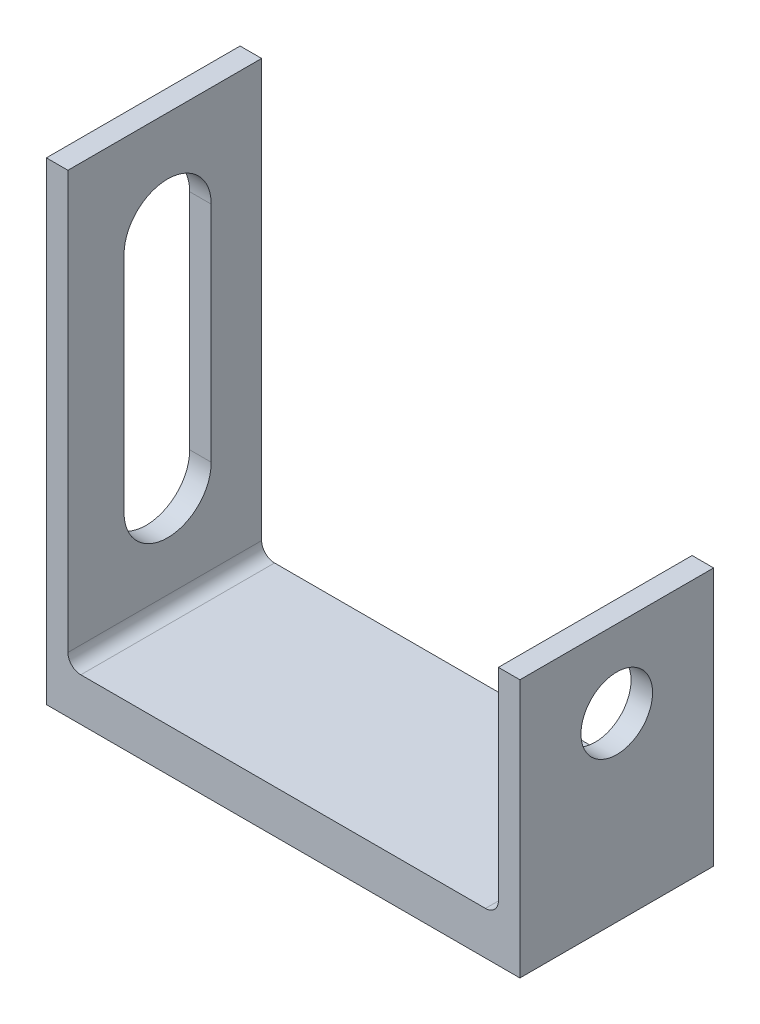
from build123d import *

# Parameters (mm, degrees)
SKETCH1_W           = 100
SKETCH1_H           = 45
SKETCH1_W_2         = 5
BOSS_EXTRUDE1_DEPTH = 10
SKETCH1_4_W         = 5
SKETCH1_4_H         = 45
BOSS_EXTRUDE2_DEPTH = 100
SKETCH1_5_W         = 5
SKETCH1_5_H         = 45
BOSS_EXTRUDE3_DEPTH = 50
FILLET1_R           = 3
FILLET2_R           = 3
CUT_EXTRUDE1_DEPTH  = 40
SKETCH4_R           = 8.315
CUT_EXTRUDE3_DEPTH  = 40


with BuildPart() as part:
    # Sketch1 → Boss-Extrude1 (new body)
    with BuildSketch(Plane(origin=(0, 0, 0), x_dir=(1, 0, 0), z_dir=(0, 1, 0))):
        with Locations((55, 22.5)):
            Rectangle(SKETCH1_W, SKETCH1_H)
        with Locations((2.5, 22.5)):
            Rectangle(SKETCH1_W_2, SKETCH1_H)
        with Locations((107.5, 22.5)):
            Rectangle(SKETCH1_W_2, SKETCH1_H)
    extrude(amount=-BOSS_EXTRUDE1_DEPTH)

    # Sketch1_4 → Boss-Extrude2 (add)
    with BuildSketch(Plane(origin=(0, 0, 0), x_dir=(1, 0, 0), z_dir=(0, 1, 0))):
        with Locations((2.5, 22.5)):
            Rectangle(SKETCH1_4_W, SKETCH1_4_H)
    extrude(amount=BOSS_EXTRUDE2_DEPTH)

    # Sketch1_5 → Boss-Extrude3 (add)
    with BuildSketch(Plane(origin=(0, 0, 0), x_dir=(1, 0, 0), z_dir=(0, 1, 0))):
        with Locations((107.5, 22.5)):
            Rectangle(SKETCH1_5_W, SKETCH1_5_H)
    extrude(amount=BOSS_EXTRUDE3_DEPTH)

    # Fillet1
    fillet1_edges = [part.edges().sort_by_distance(p)[0] for p in [
        (5, 0, -22.5),
    ]]
    fillet(fillet1_edges, radius=FILLET1_R)

    # Fillet2
    fillet2_edges = [part.edges().sort_by_distance(p)[0] for p in [
        (105, 0, -22.5),
    ]]
    fillet(fillet2_edges, radius=FILLET2_R)

    # Sketch2 → Cut-Extrude1 (cut)
    with BuildSketch(Plane(origin=(5, 0, 0), x_dir=(0, 0, -1), z_dir=(1, 0, 0))):
        with BuildLine():
            Line((33.298220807, 76.53066242), (33.298220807, 24.61066242))
            ThreePointArc((33.298220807, 24.61066242), (23.16633119, 14.478772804), (13.034441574, 24.61066242))
            Line((13.034441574, 24.61066242), (13.034441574, 76.53066242))
            ThreePointArc((13.034441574, 76.53066242), (23.16633119, 86.662552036), (33.298220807, 76.53066242))
        make_face()
    extrude(amount=-CUT_EXTRUDE1_DEPTH, mode=Mode.SUBTRACT)

    # Sketch4 → Cut-Extrude3 (cut)
    with BuildSketch(Plane(origin=(110, 0, 0), x_dir=(0, 0, -1), z_dir=(1, 0, 0))):
        with Locations((22.5, 32.004026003)):
            Circle(SKETCH4_R)
    extrude(amount=-CUT_EXTRUDE3_DEPTH, mode=Mode.SUBTRACT)


solid = part.part
